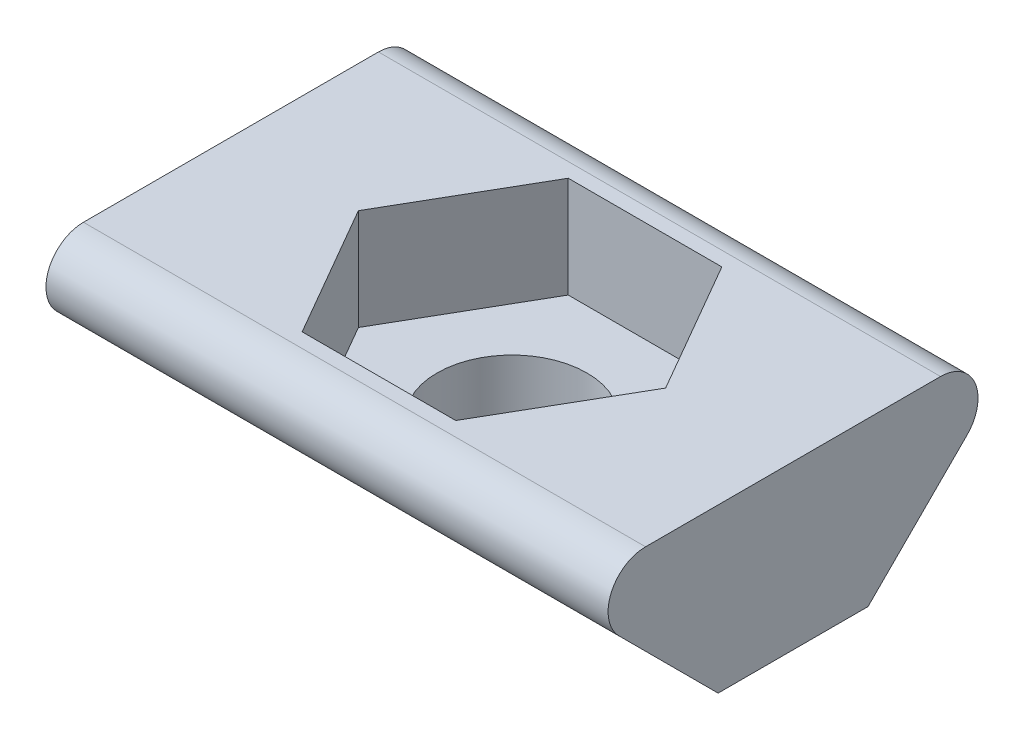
ISO-10303-21;
HEADER;
FILE_DESCRIPTION(('STEP AP214'),'2;1');
FILE_NAME('part.step','',(''),(''),'','','');
FILE_SCHEMA(('AUTOMOTIVE_DESIGN { 1 0 10303 214 1 1 1 1 }'));
ENDSEC;
DATA;
#1=APPLICATION_CONTEXT('core data for automotive mechanical design processes');
#2=APPLICATION_PROTOCOL_DEFINITION('international standard','automotive_design',2000,#1);
#3=PRODUCT_CONTEXT('',#1,'mechanical');
#4=PRODUCT('Part','Part','',(#3));
#5=PRODUCT_RELATED_PRODUCT_CATEGORY('part','',(#4));
#6=PRODUCT_DEFINITION_FORMATION('','',#4);
#7=PRODUCT_DEFINITION_CONTEXT('part definition',#1,'design');
#8=PRODUCT_DEFINITION('design','',#6,#7);
#9=PRODUCT_DEFINITION_SHAPE('','',#8);
#10=(LENGTH_UNIT() NAMED_UNIT(*) SI_UNIT(.MILLI.,.METRE.));
#11=(NAMED_UNIT(*) PLANE_ANGLE_UNIT() SI_UNIT($,.RADIAN.));
#12=(NAMED_UNIT(*) SI_UNIT($,.STERADIAN.) SOLID_ANGLE_UNIT());
#13=UNCERTAINTY_MEASURE_WITH_UNIT(LENGTH_MEASURE(1.E-05),#10,'distance_accuracy_value','');
#14=(GEOMETRIC_REPRESENTATION_CONTEXT(3) GLOBAL_UNCERTAINTY_ASSIGNED_CONTEXT((#13)) GLOBAL_UNIT_ASSIGNED_CONTEXT((#10,
#11,#12)) REPRESENTATION_CONTEXT('',''));
#15=CARTESIAN_POINT('',(0.,0.,0.));
#16=DIRECTION('',(0.,0.,1.));
#17=DIRECTION('',(1.,0.,0.));
#18=AXIS2_PLACEMENT_3D('',#15,#16,#17);
#19=CARTESIAN_POINT('',(15.,0.,-2.));
#20=DIRECTION('',(0.,1.,0.));
#21=DIRECTION('',(0.,0.,1.));
#22=AXIS2_PLACEMENT_3D('',#19,#20,#21);
#23=PLANE('',#22);
#24=DIRECTION('',(-1.,0.,0.));
#25=VECTOR('',#24,1.);
#26=CARTESIAN_POINT('',(15.,0.,2.));
#27=LINE('',#26,#25);
#28=CARTESIAN_POINT('',(15.,0.,2.));
#29=VERTEX_POINT('',#28);
#30=CARTESIAN_POINT('',(7.5,0.,2.));
#31=VERTEX_POINT('',#30);
#32=EDGE_CURVE('E151',#29,#31,#27,.T.);
#33=ORIENTED_EDGE('',*,*,#32,.T.);
#34=CARTESIAN_POINT('',(7.5,0.,0.));
#35=DIRECTION('',(0.,1.,0.));
#36=DIRECTION('',(0.,0.,1.));
#37=AXIS2_PLACEMENT_3D('',#34,#35,#36);
#38=CIRCLE('',#37,2.);
#39=CARTESIAN_POINT('',(7.5,0.,-2.));
#40=VERTEX_POINT('',#39);
#41=EDGE_CURVE('E63',#31,#40,#38,.T.);
#42=ORIENTED_EDGE('',*,*,#41,.T.);
#43=DIRECTION('',(-1.,0.,0.));
#44=VECTOR('',#43,1.);
#45=CARTESIAN_POINT('',(15.,0.,-2.));
#46=LINE('',#45,#44);
#47=CARTESIAN_POINT('',(15.,0.,-2.));
#48=VERTEX_POINT('',#47);
#49=EDGE_CURVE('E12',#48,#40,#46,.T.);
#50=ORIENTED_EDGE('',*,*,#49,.F.);
#51=DIRECTION('',(0.,0.,-1.));
#52=VECTOR('',#51,1.);
#53=CARTESIAN_POINT('',(15.,0.,-2.));
#54=LINE('',#53,#52);
#55=EDGE_CURVE('E173',#29,#48,#54,.T.);
#56=ORIENTED_EDGE('',*,*,#55,.F.);
#57=EDGE_LOOP('',(#33,#42,#50,#56));
#58=FACE_BOUND('',#57,.T.);
#59=ADVANCED_FACE('F47',(#58),#23,.F.);
#60=CARTESIAN_POINT('',(0.,0.,-2.));
#61=VERTEX_POINT('',#60);
#62=EDGE_CURVE('E59',#40,#61,#46,.T.);
#63=ORIENTED_EDGE('',*,*,#62,.F.);
#64=EDGE_CURVE('E145',#40,#31,#38,.T.);
#65=ORIENTED_EDGE('',*,*,#64,.T.);
#66=CARTESIAN_POINT('',(0.,0.,2.));
#67=VERTEX_POINT('',#66);
#68=EDGE_CURVE('E200',#31,#67,#27,.T.);
#69=ORIENTED_EDGE('',*,*,#68,.T.);
#70=DIRECTION('',(0.,0.,-1.));
#71=VECTOR('',#70,1.);
#72=CARTESIAN_POINT('',(0.,0.,-2.));
#73=LINE('',#72,#71);
#74=EDGE_CURVE('E156',#67,#61,#73,.T.);
#75=ORIENTED_EDGE('',*,*,#74,.T.);
#76=EDGE_LOOP('',(#63,#65,#69,#75));
#77=FACE_BOUND('',#76,.T.);
#78=ADVANCED_FACE('F51',(#77),#23,.F.);
#79=CARTESIAN_POINT('',(15.,2.64289321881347,-4.64289321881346));
#80=DIRECTION('',(0.,0.707106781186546,0.707106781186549));
#81=DIRECTION('',(0.,-0.707106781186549,0.707106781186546));
#82=AXIS2_PLACEMENT_3D('',#79,#80,#81);
#83=PLANE('',#82);
#84=DIRECTION('',(0.,0.707106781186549,-0.707106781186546));
#85=VECTOR('',#84,1.);
#86=CARTESIAN_POINT('',(0.,2.64289321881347,-4.64289321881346));
#87=LINE('',#86,#85);
#88=CARTESIAN_POINT('',(0.,2.64289321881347,-4.64289321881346));
#89=VERTEX_POINT('',#88);
#90=EDGE_CURVE('E204',#61,#89,#87,.T.);
#91=ORIENTED_EDGE('',*,*,#90,.T.);
#92=DIRECTION('',(-1.,0.,0.));
#93=VECTOR('',#92,1.);
#94=CARTESIAN_POINT('',(15.,2.64289321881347,-4.64289321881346));
#95=LINE('',#94,#93);
#96=CARTESIAN_POINT('',(15.,2.64289321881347,-4.64289321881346));
#97=VERTEX_POINT('',#96);
#98=EDGE_CURVE('E161',#97,#89,#95,.T.);
#99=ORIENTED_EDGE('',*,*,#98,.F.);
#100=DIRECTION('',(0.,0.707106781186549,-0.707106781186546));
#101=VECTOR('',#100,1.);
#102=CARTESIAN_POINT('',(15.,2.64289321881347,-4.64289321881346));
#103=LINE('',#102,#101);
#104=EDGE_CURVE('E168',#48,#97,#103,.T.);
#105=ORIENTED_EDGE('',*,*,#104,.F.);
#106=ORIENTED_EDGE('',*,*,#49,.T.);
#107=ORIENTED_EDGE('',*,*,#62,.T.);
#108=EDGE_LOOP('',(#91,#99,#105,#106,#107));
#109=FACE_BOUND('',#108,.T.);
#110=ADVANCED_FACE('F165',(#109),#83,.F.);
#111=CARTESIAN_POINT('',(15.,3.35000000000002,-3.93578643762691));
#112=DIRECTION('',(-1.,0.,0.));
#113=DIRECTION('',(0.,0.,1.));
#114=AXIS2_PLACEMENT_3D('',#111,#112,#113);
#115=CYLINDRICAL_SURFACE('',#114,1.);
#116=CARTESIAN_POINT('',(0.,3.35000000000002,-3.93578643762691));
#117=DIRECTION('',(1.,0.,0.));
#118=DIRECTION('',(0.,0.,1.));
#119=AXIS2_PLACEMENT_3D('',#116,#117,#118);
#120=CIRCLE('',#119,1.);
#121=CARTESIAN_POINT('',(0.,4.35000000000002,-3.93578643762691));
#122=VERTEX_POINT('',#121);
#123=EDGE_CURVE('E207',#89,#122,#120,.T.);
#124=ORIENTED_EDGE('',*,*,#123,.T.);
#125=DIRECTION('',(-1.,0.,0.));
#126=VECTOR('',#125,1.);
#127=CARTESIAN_POINT('',(15.,4.35000000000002,-3.93578643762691));
#128=LINE('',#127,#126);
#129=CARTESIAN_POINT('',(15.,4.35000000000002,-3.93578643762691));
#130=VERTEX_POINT('',#129);
#131=EDGE_CURVE('E221',#130,#122,#128,.T.);
#132=ORIENTED_EDGE('',*,*,#131,.F.);
#133=CARTESIAN_POINT('',(15.,3.35000000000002,-3.93578643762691));
#134=DIRECTION('',(1.,0.,0.));
#135=DIRECTION('',(0.,0.,1.));
#136=AXIS2_PLACEMENT_3D('',#133,#134,#135);
#137=CIRCLE('',#136,1.);
#138=EDGE_CURVE('E175',#97,#130,#137,.T.);
#139=ORIENTED_EDGE('',*,*,#138,.F.);
#140=ORIENTED_EDGE('',*,*,#98,.T.);
#141=EDGE_LOOP('',(#124,#132,#139,#140));
#142=FACE_BOUND('',#141,.T.);
#143=ADVANCED_FACE('F229',(#142),#115,.T.);
#144=CARTESIAN_POINT('',(15.,4.35000000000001,3.93578643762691));
#145=DIRECTION('',(0.,-1.,0.));
#146=DIRECTION('',(0.,0.,-1.));
#147=AXIS2_PLACEMENT_3D('',#144,#145,#146);
#148=PLANE('',#147);
#149=DIRECTION('',(-0.5,0.,-0.866025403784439));
#150=VECTOR('',#149,1.);
#151=CARTESIAN_POINT('',(11.5991869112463,4.35000000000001,0.));
#152=LINE('',#151,#150);
#153=CARTESIAN_POINT('',(11.5991869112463,4.35000000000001,0.));
#154=VERTEX_POINT('',#153);
#155=CARTESIAN_POINT('',(9.54959345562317,4.35000000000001,-3.55));
#156=VERTEX_POINT('',#155);
#157=EDGE_CURVE('E277',#154,#156,#152,.T.);
#158=ORIENTED_EDGE('',*,*,#157,.F.);
#159=DIRECTION('',(0.5,0.,-0.866025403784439));
#160=VECTOR('',#159,1.);
#161=CARTESIAN_POINT('',(9.54959345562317,4.35000000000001,3.55));
#162=LINE('',#161,#160);
#163=CARTESIAN_POINT('',(9.54959345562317,4.35000000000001,3.55));
#164=VERTEX_POINT('',#163);
#165=EDGE_CURVE('E74',#164,#154,#162,.T.);
#166=ORIENTED_EDGE('',*,*,#165,.F.);
#167=DIRECTION('',(1.,0.,0.));
#168=VECTOR('',#167,1.);
#169=CARTESIAN_POINT('',(5.45040654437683,4.35000000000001,3.55));
#170=LINE('',#169,#168);
#171=CARTESIAN_POINT('',(5.45040654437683,4.35000000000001,3.55));
#172=VERTEX_POINT('',#171);
#173=EDGE_CURVE('E305',#172,#164,#170,.T.);
#174=ORIENTED_EDGE('',*,*,#173,.F.);
#175=DIRECTION('',(0.5,0.,0.866025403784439));
#176=VECTOR('',#175,1.);
#177=CARTESIAN_POINT('',(3.40081308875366,4.35000000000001,0.));
#178=LINE('',#177,#176);
#179=CARTESIAN_POINT('',(3.40081308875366,4.35000000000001,0.));
#180=VERTEX_POINT('',#179);
#181=EDGE_CURVE('E296',#180,#172,#178,.T.);
#182=ORIENTED_EDGE('',*,*,#181,.F.);
#183=DIRECTION('',(-0.5,0.,0.866025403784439));
#184=VECTOR('',#183,1.);
#185=CARTESIAN_POINT('',(5.45040654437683,4.35000000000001,-3.55));
#186=LINE('',#185,#184);
#187=CARTESIAN_POINT('',(5.45040654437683,4.35000000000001,-3.55));
#188=VERTEX_POINT('',#187);
#189=EDGE_CURVE('E288',#188,#180,#186,.T.);
#190=ORIENTED_EDGE('',*,*,#189,.F.);
#191=DIRECTION('',(-1.,0.,0.));
#192=VECTOR('',#191,1.);
#193=CARTESIAN_POINT('',(9.54959345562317,4.35000000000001,-3.55));
#194=LINE('',#193,#192);
#195=EDGE_CURVE('E285',#156,#188,#194,.T.);
#196=ORIENTED_EDGE('',*,*,#195,.F.);
#197=EDGE_LOOP('',(#158,#166,#174,#182,#190,#196));
#198=FACE_BOUND('',#197,.T.);
#199=DIRECTION('',(0.,0.,1.));
#200=VECTOR('',#199,1.);
#201=CARTESIAN_POINT('',(0.,4.35000000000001,3.93578643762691));
#202=LINE('',#201,#200);
#203=CARTESIAN_POINT('',(0.,4.35000000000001,3.93578643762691));
#204=VERTEX_POINT('',#203);
#205=EDGE_CURVE('E209',#122,#204,#202,.T.);
#206=ORIENTED_EDGE('',*,*,#205,.T.);
#207=DIRECTION('',(-1.,0.,0.));
#208=VECTOR('',#207,1.);
#209=CARTESIAN_POINT('',(15.,4.35000000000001,3.93578643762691));
#210=LINE('',#209,#208);
#211=CARTESIAN_POINT('',(15.,4.35000000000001,3.93578643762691));
#212=VERTEX_POINT('',#211);
#213=EDGE_CURVE('E216',#212,#204,#210,.T.);
#214=ORIENTED_EDGE('',*,*,#213,.F.);
#215=DIRECTION('',(0.,0.,1.));
#216=VECTOR('',#215,1.);
#217=CARTESIAN_POINT('',(15.,4.35000000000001,3.93578643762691));
#218=LINE('',#217,#216);
#219=EDGE_CURVE('E194',#130,#212,#218,.T.);
#220=ORIENTED_EDGE('',*,*,#219,.F.);
#221=ORIENTED_EDGE('',*,*,#131,.T.);
#222=EDGE_LOOP('',(#206,#214,#220,#221));
#223=FACE_BOUND('',#222,.T.);
#224=ADVANCED_FACE('F237',(#198,#223),#148,.F.);
#225=CARTESIAN_POINT('',(15.,3.35000000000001,3.93578643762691));
#226=DIRECTION('',(-1.,0.,0.));
#227=DIRECTION('',(0.,0.,1.));
#228=AXIS2_PLACEMENT_3D('',#225,#226,#227);
#229=CYLINDRICAL_SURFACE('',#228,1.);
#230=CARTESIAN_POINT('',(0.,3.35000000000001,3.93578643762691));
#231=DIRECTION('',(1.,0.,0.));
#232=DIRECTION('',(0.,0.,-1.));
#233=AXIS2_PLACEMENT_3D('',#230,#231,#232);
#234=CIRCLE('',#233,1.);
#235=CARTESIAN_POINT('',(0.,2.64289321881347,4.64289321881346));
#236=VERTEX_POINT('',#235);
#237=EDGE_CURVE('E182',#204,#236,#234,.T.);
#238=ORIENTED_EDGE('',*,*,#237,.T.);
#239=DIRECTION('',(-1.,0.,0.));
#240=VECTOR('',#239,1.);
#241=CARTESIAN_POINT('',(15.,2.64289321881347,4.64289321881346));
#242=LINE('',#241,#240);
#243=CARTESIAN_POINT('',(15.,2.64289321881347,4.64289321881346));
#244=VERTEX_POINT('',#243);
#245=EDGE_CURVE('E218',#244,#236,#242,.T.);
#246=ORIENTED_EDGE('',*,*,#245,.F.);
#247=CARTESIAN_POINT('',(15.,3.35000000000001,3.93578643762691));
#248=DIRECTION('',(1.,0.,0.));
#249=DIRECTION('',(0.,0.,-1.));
#250=AXIS2_PLACEMENT_3D('',#247,#248,#249);
#251=CIRCLE('',#250,1.);
#252=EDGE_CURVE('E193',#212,#244,#251,.T.);
#253=ORIENTED_EDGE('',*,*,#252,.F.);
#254=ORIENTED_EDGE('',*,*,#213,.T.);
#255=EDGE_LOOP('',(#238,#246,#253,#254));
#256=FACE_BOUND('',#255,.T.);
#257=ADVANCED_FACE('F243',(#256),#229,.T.);
#258=CARTESIAN_POINT('',(15.,0.,2.));
#259=DIRECTION('',(0.,0.707106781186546,-0.707106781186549));
#260=DIRECTION('',(0.,0.707106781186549,0.707106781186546));
#261=AXIS2_PLACEMENT_3D('',#258,#259,#260);
#262=PLANE('',#261);
#263=DIRECTION('',(0.,-0.707106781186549,-0.707106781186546));
#264=VECTOR('',#263,1.);
#265=CARTESIAN_POINT('',(0.,0.,2.));
#266=LINE('',#265,#264);
#267=EDGE_CURVE('E177',#236,#67,#266,.T.);
#268=ORIENTED_EDGE('',*,*,#267,.T.);
#269=ORIENTED_EDGE('',*,*,#68,.F.);
#270=ORIENTED_EDGE('',*,*,#32,.F.);
#271=DIRECTION('',(0.,-0.707106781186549,-0.707106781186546));
#272=VECTOR('',#271,1.);
#273=CARTESIAN_POINT('',(15.,0.,2.));
#274=LINE('',#273,#272);
#275=EDGE_CURVE('E180',#244,#29,#274,.T.);
#276=ORIENTED_EDGE('',*,*,#275,.F.);
#277=ORIENTED_EDGE('',*,*,#245,.T.);
#278=EDGE_LOOP('',(#268,#269,#270,#276,#277));
#279=FACE_BOUND('',#278,.T.);
#280=ADVANCED_FACE('F246',(#279),#262,.F.);
#281=CARTESIAN_POINT('',(15.,3.35000000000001,3.93578643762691));
#282=DIRECTION('',(1.,0.,0.));
#283=DIRECTION('',(0.,0.,-1.));
#284=AXIS2_PLACEMENT_3D('',#281,#282,#283);
#285=PLANE('',#284);
#286=ORIENTED_EDGE('',*,*,#55,.T.);
#287=ORIENTED_EDGE('',*,*,#104,.T.);
#288=ORIENTED_EDGE('',*,*,#138,.T.);
#289=ORIENTED_EDGE('',*,*,#219,.T.);
#290=ORIENTED_EDGE('',*,*,#252,.T.);
#291=ORIENTED_EDGE('',*,*,#275,.T.);
#292=EDGE_LOOP('',(#286,#287,#288,#289,#290,#291));
#293=FACE_BOUND('',#292,.T.);
#294=ADVANCED_FACE('F174',(#293),#285,.T.);
#295=CARTESIAN_POINT('',(0.,3.35000000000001,3.93578643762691));
#296=DIRECTION('',(1.,0.,0.));
#297=DIRECTION('',(0.,0.,-1.));
#298=AXIS2_PLACEMENT_3D('',#295,#296,#297);
#299=PLANE('',#298);
#300=ORIENTED_EDGE('',*,*,#74,.F.);
#301=ORIENTED_EDGE('',*,*,#267,.F.);
#302=ORIENTED_EDGE('',*,*,#237,.F.);
#303=ORIENTED_EDGE('',*,*,#205,.F.);
#304=ORIENTED_EDGE('',*,*,#123,.F.);
#305=ORIENTED_EDGE('',*,*,#90,.F.);
#306=EDGE_LOOP('',(#300,#301,#302,#303,#304,#305));
#307=FACE_BOUND('',#306,.T.);
#308=ADVANCED_FACE('F234',(#307),#299,.F.);
#309=CARTESIAN_POINT('',(9.54959345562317,1.65000000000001,3.55));
#310=DIRECTION('',(0.866025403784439,0.,0.5));
#311=DIRECTION('',(0.5,0.,-0.866025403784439));
#312=AXIS2_PLACEMENT_3D('',#309,#310,#311);
#313=PLANE('',#312);
#314=ORIENTED_EDGE('',*,*,#165,.T.);
#315=DIRECTION('',(0.,1.,0.));
#316=VECTOR('',#315,1.);
#317=CARTESIAN_POINT('',(11.5991869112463,1.65000000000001,0.));
#318=LINE('',#317,#316);
#319=CARTESIAN_POINT('',(11.5991869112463,1.65000000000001,0.));
#320=VERTEX_POINT('',#319);
#321=EDGE_CURVE('E187',#320,#154,#318,.T.);
#322=ORIENTED_EDGE('',*,*,#321,.F.);
#323=DIRECTION('',(0.5,0.,-0.866025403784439));
#324=VECTOR('',#323,1.);
#325=CARTESIAN_POINT('',(9.54959345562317,1.65000000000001,3.55));
#326=LINE('',#325,#324);
#327=CARTESIAN_POINT('',(9.54959345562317,1.65000000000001,3.55));
#328=VERTEX_POINT('',#327);
#329=EDGE_CURVE('E306',#328,#320,#326,.T.);
#330=ORIENTED_EDGE('',*,*,#329,.F.);
#331=DIRECTION('',(0.,1.,0.));
#332=VECTOR('',#331,1.);
#333=CARTESIAN_POINT('',(9.54959345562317,1.65000000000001,3.55));
#334=LINE('',#333,#332);
#335=EDGE_CURVE('E205',#328,#164,#334,.T.);
#336=ORIENTED_EDGE('',*,*,#335,.T.);
#337=EDGE_LOOP('',(#314,#322,#330,#336));
#338=FACE_BOUND('',#337,.T.);
#339=ADVANCED_FACE('F357',(#338),#313,.F.);
#340=CARTESIAN_POINT('',(5.45040654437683,1.65000000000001,3.55));
#341=DIRECTION('',(0.,0.,1.));
#342=DIRECTION('',(1.,0.,0.));
#343=AXIS2_PLACEMENT_3D('',#340,#341,#342);
#344=PLANE('',#343);
#345=ORIENTED_EDGE('',*,*,#173,.T.);
#346=ORIENTED_EDGE('',*,*,#335,.F.);
#347=DIRECTION('',(1.,0.,0.));
#348=VECTOR('',#347,1.);
#349=CARTESIAN_POINT('',(5.45040654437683,1.65000000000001,3.55));
#350=LINE('',#349,#348);
#351=CARTESIAN_POINT('',(5.45040654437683,1.65000000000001,3.55));
#352=VERTEX_POINT('',#351);
#353=EDGE_CURVE('E321',#352,#328,#350,.T.);
#354=ORIENTED_EDGE('',*,*,#353,.F.);
#355=DIRECTION('',(0.,1.,0.));
#356=VECTOR('',#355,1.);
#357=CARTESIAN_POINT('',(5.45040654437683,1.65000000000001,3.55));
#358=LINE('',#357,#356);
#359=EDGE_CURVE('E307',#352,#172,#358,.T.);
#360=ORIENTED_EDGE('',*,*,#359,.T.);
#361=EDGE_LOOP('',(#345,#346,#354,#360));
#362=FACE_BOUND('',#361,.T.);
#363=ADVANCED_FACE('F370',(#362),#344,.F.);
#364=CARTESIAN_POINT('',(3.40081308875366,1.65000000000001,0.));
#365=DIRECTION('',(-0.866025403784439,0.,0.5));
#366=DIRECTION('',(0.5,0.,0.866025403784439));
#367=AXIS2_PLACEMENT_3D('',#364,#365,#366);
#368=PLANE('',#367);
#369=ORIENTED_EDGE('',*,*,#181,.T.);
#370=ORIENTED_EDGE('',*,*,#359,.F.);
#371=DIRECTION('',(0.5,0.,0.866025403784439));
#372=VECTOR('',#371,1.);
#373=CARTESIAN_POINT('',(3.40081308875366,1.65000000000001,0.));
#374=LINE('',#373,#372);
#375=CARTESIAN_POINT('',(3.40081308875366,1.65000000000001,0.));
#376=VERTEX_POINT('',#375);
#377=EDGE_CURVE('E328',#376,#352,#374,.T.);
#378=ORIENTED_EDGE('',*,*,#377,.F.);
#379=DIRECTION('',(0.,1.,0.));
#380=VECTOR('',#379,1.);
#381=CARTESIAN_POINT('',(3.40081308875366,1.65000000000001,0.));
#382=LINE('',#381,#380);
#383=EDGE_CURVE('E315',#376,#180,#382,.T.);
#384=ORIENTED_EDGE('',*,*,#383,.T.);
#385=EDGE_LOOP('',(#369,#370,#378,#384));
#386=FACE_BOUND('',#385,.T.);
#387=ADVANCED_FACE('F362',(#386),#368,.F.);
#388=CARTESIAN_POINT('',(5.45040654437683,1.65000000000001,-3.55));
#389=DIRECTION('',(-0.866025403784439,0.,-0.5));
#390=DIRECTION('',(-0.5,0.,0.866025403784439));
#391=AXIS2_PLACEMENT_3D('',#388,#389,#390);
#392=PLANE('',#391);
#393=ORIENTED_EDGE('',*,*,#189,.T.);
#394=ORIENTED_EDGE('',*,*,#383,.F.);
#395=DIRECTION('',(-0.5,0.,0.866025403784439));
#396=VECTOR('',#395,1.);
#397=CARTESIAN_POINT('',(5.45040654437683,1.65000000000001,-3.55));
#398=LINE('',#397,#396);
#399=CARTESIAN_POINT('',(5.45040654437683,1.65000000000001,-3.55));
#400=VERTEX_POINT('',#399);
#401=EDGE_CURVE('E334',#400,#376,#398,.T.);
#402=ORIENTED_EDGE('',*,*,#401,.F.);
#403=DIRECTION('',(0.,1.,0.));
#404=VECTOR('',#403,1.);
#405=CARTESIAN_POINT('',(5.45040654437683,1.65000000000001,-3.55));
#406=LINE('',#405,#404);
#407=EDGE_CURVE('E314',#400,#188,#406,.T.);
#408=ORIENTED_EDGE('',*,*,#407,.T.);
#409=EDGE_LOOP('',(#393,#394,#402,#408));
#410=FACE_BOUND('',#409,.T.);
#411=ADVANCED_FACE('F365',(#410),#392,.F.);
#412=CARTESIAN_POINT('',(9.54959345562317,1.65000000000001,-3.55));
#413=DIRECTION('',(0.,0.,-1.));
#414=DIRECTION('',(-1.,0.,0.));
#415=AXIS2_PLACEMENT_3D('',#412,#413,#414);
#416=PLANE('',#415);
#417=ORIENTED_EDGE('',*,*,#195,.T.);
#418=ORIENTED_EDGE('',*,*,#407,.F.);
#419=DIRECTION('',(-1.,0.,0.));
#420=VECTOR('',#419,1.);
#421=CARTESIAN_POINT('',(9.54959345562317,1.65000000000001,-3.55));
#422=LINE('',#421,#420);
#423=CARTESIAN_POINT('',(9.54959345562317,1.65000000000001,-3.55));
#424=VERTEX_POINT('',#423);
#425=EDGE_CURVE('E336',#424,#400,#422,.T.);
#426=ORIENTED_EDGE('',*,*,#425,.F.);
#427=DIRECTION('',(0.,1.,0.));
#428=VECTOR('',#427,1.);
#429=CARTESIAN_POINT('',(9.54959345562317,1.65000000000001,-3.55));
#430=LINE('',#429,#428);
#431=EDGE_CURVE('E320',#424,#156,#430,.T.);
#432=ORIENTED_EDGE('',*,*,#431,.T.);
#433=EDGE_LOOP('',(#417,#418,#426,#432));
#434=FACE_BOUND('',#433,.T.);
#435=ADVANCED_FACE('F356',(#434),#416,.F.);
#436=CARTESIAN_POINT('',(11.5991869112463,1.65000000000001,0.));
#437=DIRECTION('',(0.866025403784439,0.,-0.5));
#438=DIRECTION('',(-0.5,0.,-0.866025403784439));
#439=AXIS2_PLACEMENT_3D('',#436,#437,#438);
#440=PLANE('',#439);
#441=ORIENTED_EDGE('',*,*,#157,.T.);
#442=ORIENTED_EDGE('',*,*,#431,.F.);
#443=DIRECTION('',(-0.5,0.,-0.866025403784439));
#444=VECTOR('',#443,1.);
#445=CARTESIAN_POINT('',(11.5991869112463,1.65000000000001,0.));
#446=LINE('',#445,#444);
#447=EDGE_CURVE('E341',#320,#424,#446,.T.);
#448=ORIENTED_EDGE('',*,*,#447,.F.);
#449=ORIENTED_EDGE('',*,*,#321,.T.);
#450=EDGE_LOOP('',(#441,#442,#448,#449));
#451=FACE_BOUND('',#450,.T.);
#452=ADVANCED_FACE('F351',(#451),#440,.F.);
#453=CARTESIAN_POINT('',(0.,1.65000000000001,0.));
#454=DIRECTION('',(0.,1.,0.));
#455=DIRECTION('',(0.,0.,1.));
#456=AXIS2_PLACEMENT_3D('',#453,#454,#455);
#457=PLANE('',#456);
#458=CARTESIAN_POINT('',(7.5,1.65000000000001,0.));
#459=DIRECTION('',(0.,1.,0.));
#460=DIRECTION('',(0.,0.,1.));
#461=AXIS2_PLACEMENT_3D('',#458,#459,#460);
#462=CIRCLE('',#461,2.);
#463=CARTESIAN_POINT('',(7.5,1.65000000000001,2.));
#464=VERTEX_POINT('',#463);
#465=EDGE_CURVE('E150',#464,#464,#462,.T.);
#466=ORIENTED_EDGE('',*,*,#465,.F.);
#467=EDGE_LOOP('',(#466));
#468=FACE_BOUND('',#467,.T.);
#469=ORIENTED_EDGE('',*,*,#329,.T.);
#470=ORIENTED_EDGE('',*,*,#447,.T.);
#471=ORIENTED_EDGE('',*,*,#425,.T.);
#472=ORIENTED_EDGE('',*,*,#401,.T.);
#473=ORIENTED_EDGE('',*,*,#377,.T.);
#474=ORIENTED_EDGE('',*,*,#353,.T.);
#475=EDGE_LOOP('',(#469,#470,#471,#472,#473,#474));
#476=FACE_BOUND('',#475,.T.);
#477=ADVANCED_FACE('F355',(#468,#476),#457,.T.);
#478=CARTESIAN_POINT('',(7.5,-13.35,0.));
#479=DIRECTION('',(0.,1.,0.));
#480=DIRECTION('',(0.,0.,1.));
#481=AXIS2_PLACEMENT_3D('',#478,#479,#480);
#482=CYLINDRICAL_SURFACE('',#481,2.);
#483=ORIENTED_EDGE('',*,*,#465,.T.);
#484=EDGE_LOOP('',(#483));
#485=FACE_BOUND('',#484,.T.);
#486=ORIENTED_EDGE('',*,*,#64,.F.);
#487=ORIENTED_EDGE('',*,*,#41,.F.);
#488=EDGE_LOOP('',(#486,#487));
#489=FACE_BOUND('',#488,.T.);
#490=ADVANCED_FACE('F141',(#485,#489),#482,.F.);
#491=CLOSED_SHELL('',(#59,#78,#110,#143,#224,#257,#280,#294,#308,#339,#363,#387,#411,#435,#452,
#477,#490));
#492=MANIFOLD_SOLID_BREP('B2',#491);
#493=ADVANCED_BREP_SHAPE_REPRESENTATION('',(#18,#492),#14);
#494=SHAPE_DEFINITION_REPRESENTATION(#9,#493);
ENDSEC;
END-ISO-10303-21;
